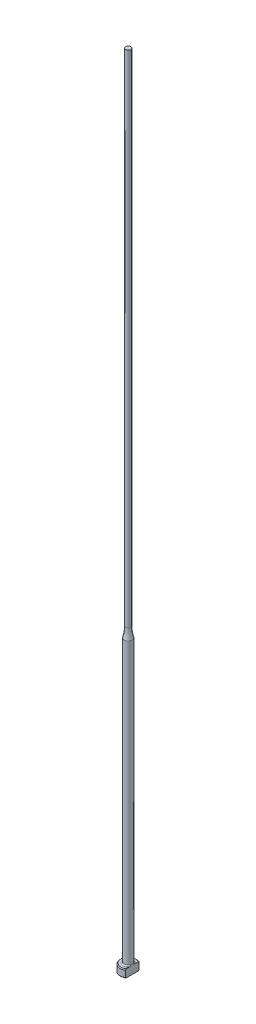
ISO-10303-21;
HEADER;
FILE_DESCRIPTION(('STEP AP214'),'2;1');
FILE_NAME('part.step','',(''),(''),'','','');
FILE_SCHEMA(('AUTOMOTIVE_DESIGN { 1 0 10303 214 1 1 1 1 }'));
ENDSEC;
DATA;
#1=APPLICATION_CONTEXT('core data for automotive mechanical design processes');
#2=APPLICATION_PROTOCOL_DEFINITION('international standard','automotive_design',2000,#1);
#3=PRODUCT_CONTEXT('',#1,'mechanical');
#4=PRODUCT('Part','Part','',(#3));
#5=PRODUCT_RELATED_PRODUCT_CATEGORY('part','',(#4));
#6=PRODUCT_DEFINITION_FORMATION('','',#4);
#7=PRODUCT_DEFINITION_CONTEXT('part definition',#1,'design');
#8=PRODUCT_DEFINITION('design','',#6,#7);
#9=PRODUCT_DEFINITION_SHAPE('','',#8);
#10=(LENGTH_UNIT() NAMED_UNIT(*) SI_UNIT(.MILLI.,.METRE.));
#11=(NAMED_UNIT(*) PLANE_ANGLE_UNIT() SI_UNIT($,.RADIAN.));
#12=(NAMED_UNIT(*) SI_UNIT($,.STERADIAN.) SOLID_ANGLE_UNIT());
#13=UNCERTAINTY_MEASURE_WITH_UNIT(LENGTH_MEASURE(1.E-05),#10,'distance_accuracy_value','');
#14=(GEOMETRIC_REPRESENTATION_CONTEXT(3) GLOBAL_UNCERTAINTY_ASSIGNED_CONTEXT((#13)) GLOBAL_UNIT_ASSIGNED_CONTEXT((#10,
#11,#12)) REPRESENTATION_CONTEXT('',''));
#15=CARTESIAN_POINT('',(0.,0.,0.));
#16=DIRECTION('',(0.,0.,1.));
#17=DIRECTION('',(1.,0.,0.));
#18=AXIS2_PLACEMENT_3D('',#15,#16,#17);
#19=CARTESIAN_POINT('',(-1.99999999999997,2.,0.));
#20=DIRECTION('',(0.,1.,0.));
#21=DIRECTION('',(0.,0.,1.));
#22=AXIS2_PLACEMENT_3D('',#19,#20,#21);
#23=PLANE('',#22);
#24=CARTESIAN_POINT('',(0.,2.,0.));
#25=DIRECTION('',(0.,1.,0.));
#26=DIRECTION('',(0.,0.,1.));
#27=AXIS2_PLACEMENT_3D('',#24,#25,#26);
#28=CIRCLE('',#27,1.8);
#29=CARTESIAN_POINT('',(0.999999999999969,2.,-1.4966629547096));
#30=VERTEX_POINT('',#29);
#31=CARTESIAN_POINT('',(0.999999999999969,2.,1.4966629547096));
#32=VERTEX_POINT('',#31);
#33=EDGE_CURVE('E187',#30,#32,#28,.T.);
#34=ORIENTED_EDGE('',*,*,#33,.T.);
#35=DIRECTION('',(0.,0.,-1.));
#36=VECTOR('',#35,1.);
#37=CARTESIAN_POINT('',(0.999999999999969,2.,0.));
#38=LINE('',#37,#36);
#39=CARTESIAN_POINT('',(0.999999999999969,2.00000000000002,0.830662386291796));
#40=VERTEX_POINT('',#39);
#41=EDGE_CURVE('E57',#32,#40,#38,.T.);
#42=ORIENTED_EDGE('',*,*,#41,.T.);
#43=CARTESIAN_POINT('',(0.,2.,0.));
#44=DIRECTION('',(0.,1.,0.));
#45=DIRECTION('',(0.,0.,1.));
#46=AXIS2_PLACEMENT_3D('',#43,#44,#45);
#47=CIRCLE('',#46,1.29999999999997);
#48=CARTESIAN_POINT('',(0.999999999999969,2.00000000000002,-0.830662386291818));
#49=VERTEX_POINT('',#48);
#50=EDGE_CURVE('E108',#40,#49,#47,.F.);
#51=ORIENTED_EDGE('',*,*,#50,.T.);
#52=EDGE_CURVE('E137',#49,#30,#38,.T.);
#53=ORIENTED_EDGE('',*,*,#52,.T.);
#54=EDGE_LOOP('',(#34,#42,#51,#53));
#55=FACE_BOUND('',#54,.T.);
#56=ADVANCED_FACE('F32',(#55),#23,.T.);
#57=CARTESIAN_POINT('',(0.,259.958771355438,0.));
#58=DIRECTION('',(0.,1.,0.));
#59=DIRECTION('',(0.,0.,1.));
#60=AXIS2_PLACEMENT_3D('',#57,#58,#59);
#61=CYLINDRICAL_SURFACE('',#60,1.99999999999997);
#62=CARTESIAN_POINT('',(0.,1.80000000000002,0.));
#63=DIRECTION('',(0.,1.,0.));
#64=DIRECTION('',(0.,0.,1.));
#65=AXIS2_PLACEMENT_3D('',#62,#63,#64);
#66=CIRCLE('',#65,1.99999999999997);
#67=CARTESIAN_POINT('',(0.999999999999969,1.80000000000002,1.73205080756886));
#68=VERTEX_POINT('',#67);
#69=CARTESIAN_POINT('',(0.999999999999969,1.80000000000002,-1.73205080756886));
#70=VERTEX_POINT('',#69);
#71=EDGE_CURVE('E105',#68,#70,#66,.F.);
#72=ORIENTED_EDGE('',*,*,#71,.T.);
#73=DIRECTION('',(0.,-1.,0.));
#74=VECTOR('',#73,1.);
#75=CARTESIAN_POINT('',(0.999999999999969,200.,-1.73205080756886));
#76=LINE('',#75,#74);
#77=CARTESIAN_POINT('',(0.999999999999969,0.199999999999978,-1.73205080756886));
#78=VERTEX_POINT('',#77);
#79=EDGE_CURVE('E193',#70,#78,#76,.T.);
#80=ORIENTED_EDGE('',*,*,#79,.T.);
#81=CARTESIAN_POINT('',(0.,0.199999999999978,0.));
#82=DIRECTION('',(0.,-1.,0.));
#83=DIRECTION('',(0.,0.,-1.));
#84=AXIS2_PLACEMENT_3D('',#81,#82,#83);
#85=CIRCLE('',#84,1.99999999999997);
#86=CARTESIAN_POINT('',(0.999999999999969,0.199999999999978,1.73205080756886));
#87=VERTEX_POINT('',#86);
#88=EDGE_CURVE('E100',#78,#87,#85,.F.);
#89=ORIENTED_EDGE('',*,*,#88,.T.);
#90=DIRECTION('',(0.,-1.,0.));
#91=VECTOR('',#90,1.);
#92=CARTESIAN_POINT('',(0.999999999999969,200.,1.73205080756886));
#93=LINE('',#92,#91);
#94=EDGE_CURVE('E93',#68,#87,#93,.T.);
#95=ORIENTED_EDGE('',*,*,#94,.F.);
#96=EDGE_LOOP('',(#72,#80,#89,#95));
#97=FACE_BOUND('',#96,.T.);
#98=ADVANCED_FACE('F158',(#97),#61,.T.);
#99=CARTESIAN_POINT('',(0.,0.,0.));
#100=DIRECTION('',(0.,-1.,0.));
#101=DIRECTION('',(0.,0.,-1.));
#102=AXIS2_PLACEMENT_3D('',#99,#100,#101);
#103=PLANE('',#102);
#104=CARTESIAN_POINT('',(0.,0.,0.));
#105=DIRECTION('',(0.,-1.,0.));
#106=DIRECTION('',(0.,0.,-1.));
#107=AXIS2_PLACEMENT_3D('',#104,#105,#106);
#108=CIRCLE('',#107,1.8);
#109=CARTESIAN_POINT('',(0.999999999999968,0.,1.49666295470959));
#110=VERTEX_POINT('',#109);
#111=CARTESIAN_POINT('',(0.999999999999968,0.,-1.49666295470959));
#112=VERTEX_POINT('',#111);
#113=EDGE_CURVE('E98',#110,#112,#108,.T.);
#114=ORIENTED_EDGE('',*,*,#113,.T.);
#115=DIRECTION('',(0.,0.,1.));
#116=VECTOR('',#115,1.);
#117=CARTESIAN_POINT('',(0.999999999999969,0.,-1.73205080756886));
#118=LINE('',#117,#116);
#119=EDGE_CURVE('E83',#112,#110,#118,.T.);
#120=ORIENTED_EDGE('',*,*,#119,.T.);
#121=EDGE_LOOP('',(#114,#120));
#122=FACE_BOUND('',#121,.T.);
#123=ADVANCED_FACE('F103',(#122),#103,.T.);
#124=CARTESIAN_POINT('',(0.,2.,0.));
#125=DIRECTION('',(0.,-1.,0.));
#126=DIRECTION('',(0.,0.,-1.));
#127=AXIS2_PLACEMENT_3D('',#124,#125,#126);
#128=CONICAL_SURFACE('',#127,1.8,0.785398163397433);
#129=ORIENTED_EDGE('',*,*,#71,.F.);
#130=CARTESIAN_POINT('',(0.999999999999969,-0.143084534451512,3.81417299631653));
#131=CARTESIAN_POINT('',(0.999999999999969,-0.0593997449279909,3.72765647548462));
#132=CARTESIAN_POINT('',(0.999999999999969,0.0241940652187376,3.64105173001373));
#133=CARTESIAN_POINT('',(0.999999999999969,0.191148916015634,3.46761616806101));
#134=CARTESIAN_POINT('',(0.999999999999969,0.274509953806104,3.38078534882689));
#135=CARTESIAN_POINT('',(0.999999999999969,0.524249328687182,3.11979400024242));
#136=CARTESIAN_POINT('',(0.999999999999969,0.690198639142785,2.94522254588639));
#137=CARTESIAN_POINT('',(0.999999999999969,1.016975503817,2.59782670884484));
#138=CARTESIAN_POINT('',(0.999999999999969,1.17783928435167,2.42503661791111));
#139=CARTESIAN_POINT('',(0.999999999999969,1.41669118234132,2.16364984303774));
#140=CARTESIAN_POINT('',(0.999999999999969,1.49589273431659,2.07616357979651));
#141=CARTESIAN_POINT('',(0.999999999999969,1.65313803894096,1.90015721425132));
#142=CARTESIAN_POINT('',(0.999999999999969,1.73118183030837,1.81163714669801));
#143=CARTESIAN_POINT('',(0.999999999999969,1.85567318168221,1.66767927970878));
#144=CARTESIAN_POINT('',(0.999999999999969,1.90265415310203,1.61270332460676));
#145=CARTESIAN_POINT('',(0.999999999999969,1.99577882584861,1.50203557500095));
#146=CARTESIAN_POINT('',(0.999999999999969,2.04192244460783,1.44634371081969));
#147=CARTESIAN_POINT('',(0.999999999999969,2.1335659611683,1.3334548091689));
#148=CARTESIAN_POINT('',(0.999999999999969,2.17905399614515,1.2762481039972));
#149=CARTESIAN_POINT('',(0.999999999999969,2.26844283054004,1.16060976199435));
#150=CARTESIAN_POINT('',(0.999999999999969,2.31234379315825,1.10217825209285));
#151=CARTESIAN_POINT('',(0.999999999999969,2.39853453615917,0.982773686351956));
#152=CARTESIAN_POINT('',(0.999999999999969,2.44078986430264,0.921775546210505));
#153=CARTESIAN_POINT('',(0.999999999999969,2.52187810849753,0.797387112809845));
#154=CARTESIAN_POINT('',(0.999999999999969,2.56070631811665,0.733993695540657));
#155=CARTESIAN_POINT('',(0.999999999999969,2.63248592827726,0.604932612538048));
#156=CARTESIAN_POINT('',(0.999999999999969,2.66550424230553,0.539302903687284));
#157=CARTESIAN_POINT('',(0.999999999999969,2.72301550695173,0.404437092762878));
#158=CARTESIAN_POINT('',(0.999999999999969,2.74753707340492,0.33521401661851));
#159=CARTESIAN_POINT('',(0.999999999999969,2.77407110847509,0.231400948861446));
#160=CARTESIAN_POINT('',(0.999999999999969,2.7811074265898,0.198093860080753));
#161=CARTESIAN_POINT('',(0.999999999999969,2.79200506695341,0.130954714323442));
#162=CARTESIAN_POINT('',(0.999999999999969,2.79586666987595,0.0971227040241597));
#163=CARTESIAN_POINT('',(0.999999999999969,2.8001390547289,0.0293410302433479));
#164=CARTESIAN_POINT('',(0.999999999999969,2.80056046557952,-0.00460794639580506));
#165=CARTESIAN_POINT('',(0.999999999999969,2.79795882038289,-0.0723663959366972));
#166=CARTESIAN_POINT('',(0.999999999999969,2.79493547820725,-0.106175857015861));
#167=CARTESIAN_POINT('',(0.999999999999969,2.78105481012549,-0.206326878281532));
#168=CARTESIAN_POINT('',(0.999999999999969,2.7654214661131,-0.272037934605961));
#169=CARTESIAN_POINT('',(0.999999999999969,2.73477554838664,-0.368312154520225));
#170=CARTESIAN_POINT('',(0.999999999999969,2.72331063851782,-0.40012349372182));
#171=CARTESIAN_POINT('',(0.999999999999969,2.69840546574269,-0.462964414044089));
#172=CARTESIAN_POINT('',(0.999999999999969,2.68496560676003,-0.493994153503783));
#173=CARTESIAN_POINT('',(0.999999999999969,2.64209309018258,-0.586298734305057));
#174=CARTESIAN_POINT('',(0.999999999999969,2.61022871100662,-0.64643570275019));
#175=CARTESIAN_POINT('',(0.999999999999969,2.54228534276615,-0.764304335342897));
#176=CARTESIAN_POINT('',(0.999999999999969,2.50620119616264,-0.822032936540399));
#177=CARTESIAN_POINT('',(0.999999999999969,2.43107084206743,-0.935840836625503));
#178=CARTESIAN_POINT('',(0.999999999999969,2.39201347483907,-0.991912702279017));
#179=CARTESIAN_POINT('',(0.999999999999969,2.31195870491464,-1.10259849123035));
#180=CARTESIAN_POINT('',(0.999999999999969,2.27096226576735,-1.15721311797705));
#181=CARTESIAN_POINT('',(0.999999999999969,2.18701695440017,-1.26606869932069));
#182=CARTESIAN_POINT('',(0.999999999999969,2.14404946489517,-1.32029522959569));
#183=CARTESIAN_POINT('',(0.999999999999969,2.05705050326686,-1.4278898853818));
#184=CARTESIAN_POINT('',(0.999999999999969,2.01301896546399,-1.48125795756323));
#185=CARTESIAN_POINT('',(0.999999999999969,1.87995068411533,-1.64010952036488));
#186=CARTESIAN_POINT('',(0.999999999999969,1.78973357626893,-1.74460261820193));
#187=CARTESIAN_POINT('',(0.999999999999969,1.62290341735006,-1.93426834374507));
#188=CARTESIAN_POINT('',(0.999999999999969,1.54658658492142,-2.01970404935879));
#189=CARTESIAN_POINT('',(0.999999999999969,1.39301250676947,-2.18973019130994));
#190=CARTESIAN_POINT('',(0.999999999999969,1.31575523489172,-2.27432060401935));
#191=CARTESIAN_POINT('',(0.999999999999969,1.08283440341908,-2.52732479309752));
#192=CARTESIAN_POINT('',(0.999999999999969,0.926165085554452,-2.69481086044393));
#193=CARTESIAN_POINT('',(0.999999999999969,0.617772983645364,-3.02147252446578));
#194=CARTESIAN_POINT('',(0.999999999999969,0.466111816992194,-3.18070657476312));
#195=CARTESIAN_POINT('',(0.999999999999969,0.238015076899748,-3.41880818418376));
#196=CARTESIAN_POINT('',(0.999999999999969,0.161924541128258,-3.49800657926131));
#197=CARTESIAN_POINT('',(0.999999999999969,0.009553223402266,-3.65621892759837));
#198=CARTESIAN_POINT('',(0.999999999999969,-0.0667275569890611,-3.73523288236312));
#199=CARTESIAN_POINT('',(0.999999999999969,-0.143084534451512,-3.81417299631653));
#200=B_SPLINE_CURVE_WITH_KNOTS('',3,(#130,#131,#132,#133,#134,#135,#136,#137,#138,#139,#140,
#141,#142,#143,#144,#145,#146,#147,#148,#149,#150,#151,#152,#153,#154,#155,#156,#157,#158,#159,
#160,#161,#162,#163,#164,#165,#166,#167,#168,#169,#170,#171,#172,#173,#174,#175,#176,#177,#178,
#179,#180,#181,#182,#183,#184,#185,#186,#187,#188,#189,#190,#191,#192,#193,#194,#195,#196,#197,
#198,#199),.UNSPECIFIED.,.F.,.F.,(4,2,2,2,2,2,2,2,2,2,2,2,2,2,2,2,2,2,2,2,2,2,2,2,2,2,2,2,2,2,2,
2,2,2,4),(0.,0.36110162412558,0.722207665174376,1.44478731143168,2.15299784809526,
2.5070263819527,2.8610430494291,3.07798416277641,3.29494655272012,3.51418925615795,
3.73340935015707,3.95594813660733,4.17878792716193,4.39886399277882,4.61819150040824,
4.72018864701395,4.82217677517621,4.92384967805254,5.02553102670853,5.22698459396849,
5.32838854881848,5.42977179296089,5.63365200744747,5.83778406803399,6.04272417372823,
6.24756349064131,6.45510395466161,6.66265726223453,7.07676259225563,7.42043039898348,
7.7641077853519,8.45210822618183,9.1118082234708,9.44129145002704,9.77077197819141),.UNSPECIFIED.);
#201=EDGE_CURVE('E136',#68,#32,#200,.T.);
#202=ORIENTED_EDGE('',*,*,#201,.T.);
#203=ORIENTED_EDGE('',*,*,#33,.F.);
#204=EDGE_CURVE('E128',#30,#70,#200,.T.);
#205=ORIENTED_EDGE('',*,*,#204,.T.);
#206=EDGE_LOOP('',(#129,#202,#203,#205));
#207=FACE_BOUND('',#206,.T.);
#208=ADVANCED_FACE('F144',(#207),#128,.T.);
#209=CARTESIAN_POINT('',(0.,0.199999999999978,0.));
#210=DIRECTION('',(0.,1.,0.));
#211=DIRECTION('',(0.,0.,1.));
#212=AXIS2_PLACEMENT_3D('',#209,#210,#211);
#213=CONICAL_SURFACE('',#212,1.99999999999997,0.785398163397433);
#214=ORIENTED_EDGE('',*,*,#88,.F.);
#215=CARTESIAN_POINT('',(0.999999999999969,2.14308453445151,-3.81417299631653));
#216=CARTESIAN_POINT('',(0.999999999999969,2.05939974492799,-3.72765647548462));
#217=CARTESIAN_POINT('',(0.999999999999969,1.97580593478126,-3.64105173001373));
#218=CARTESIAN_POINT('',(0.999999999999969,1.80885108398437,-3.46761616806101));
#219=CARTESIAN_POINT('',(0.999999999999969,1.7254900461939,-3.38078534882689));
#220=CARTESIAN_POINT('',(0.999999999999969,1.47575067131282,-3.11979400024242));
#221=CARTESIAN_POINT('',(0.999999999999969,1.30980136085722,-2.94522254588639));
#222=CARTESIAN_POINT('',(0.999999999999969,0.983024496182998,-2.59782670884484));
#223=CARTESIAN_POINT('',(0.999999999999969,0.822160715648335,-2.42503661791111));
#224=CARTESIAN_POINT('',(0.999999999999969,0.583308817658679,-2.16364984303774));
#225=CARTESIAN_POINT('',(0.999999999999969,0.504107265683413,-2.07616357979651));
#226=CARTESIAN_POINT('',(0.999999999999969,0.346861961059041,-1.90015721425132));
#227=CARTESIAN_POINT('',(0.999999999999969,0.268818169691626,-1.81163714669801));
#228=CARTESIAN_POINT('',(0.999999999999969,0.144326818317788,-1.66767927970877));
#229=CARTESIAN_POINT('',(0.999999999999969,0.0973458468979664,-1.61270332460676));
#230=CARTESIAN_POINT('',(0.999999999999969,0.00422117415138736,-1.50203557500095));
#231=CARTESIAN_POINT('',(0.999999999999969,-0.0419224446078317,-1.44634371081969));
#232=CARTESIAN_POINT('',(0.999999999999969,-0.133565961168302,-1.3334548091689));
#233=CARTESIAN_POINT('',(0.999999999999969,-0.179053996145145,-1.2762481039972));
#234=CARTESIAN_POINT('',(0.999999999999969,-0.268442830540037,-1.16060976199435));
#235=CARTESIAN_POINT('',(0.999999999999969,-0.31234379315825,-1.10217825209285));
#236=CARTESIAN_POINT('',(0.999999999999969,-0.398534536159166,-0.982773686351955));
#237=CARTESIAN_POINT('',(0.999999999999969,-0.440789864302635,-0.921775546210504));
#238=CARTESIAN_POINT('',(0.999999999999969,-0.521878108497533,-0.797387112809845));
#239=CARTESIAN_POINT('',(0.999999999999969,-0.560706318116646,-0.733993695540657));
#240=CARTESIAN_POINT('',(0.999999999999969,-0.632485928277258,-0.604932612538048));
#241=CARTESIAN_POINT('',(0.999999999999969,-0.665504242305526,-0.539302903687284));
#242=CARTESIAN_POINT('',(0.999999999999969,-0.723015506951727,-0.404437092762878));
#243=CARTESIAN_POINT('',(0.999999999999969,-0.747537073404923,-0.33521401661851));
#244=CARTESIAN_POINT('',(0.999999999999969,-0.774071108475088,-0.231400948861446));
#245=CARTESIAN_POINT('',(0.999999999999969,-0.781107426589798,-0.198093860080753));
#246=CARTESIAN_POINT('',(0.999999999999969,-0.792005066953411,-0.130954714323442));
#247=CARTESIAN_POINT('',(0.999999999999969,-0.795866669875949,-0.0971227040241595));
#248=CARTESIAN_POINT('',(0.999999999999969,-0.800139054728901,-0.0293410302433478));
#249=CARTESIAN_POINT('',(0.999999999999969,-0.80056046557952,0.00460794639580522));
#250=CARTESIAN_POINT('',(0.999999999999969,-0.797958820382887,0.0723663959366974));
#251=CARTESIAN_POINT('',(0.999999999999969,-0.794935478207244,0.106175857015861));
#252=CARTESIAN_POINT('',(0.999999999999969,-0.78105481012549,0.206326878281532));
#253=CARTESIAN_POINT('',(0.999999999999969,-0.765421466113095,0.272037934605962));
#254=CARTESIAN_POINT('',(0.999999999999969,-0.734775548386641,0.368312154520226));
#255=CARTESIAN_POINT('',(0.999999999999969,-0.723310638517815,0.40012349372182));
#256=CARTESIAN_POINT('',(0.999999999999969,-0.698405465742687,0.46296441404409));
#257=CARTESIAN_POINT('',(0.999999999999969,-0.684965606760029,0.493994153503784));
#258=CARTESIAN_POINT('',(0.999999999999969,-0.642093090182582,0.586298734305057));
#259=CARTESIAN_POINT('',(0.999999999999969,-0.610228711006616,0.64643570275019));
#260=CARTESIAN_POINT('',(0.999999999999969,-0.542285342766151,0.764304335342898));
#261=CARTESIAN_POINT('',(0.999999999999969,-0.506201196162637,0.822032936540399));
#262=CARTESIAN_POINT('',(0.999999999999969,-0.431070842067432,0.935840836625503));
#263=CARTESIAN_POINT('',(0.999999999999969,-0.392013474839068,0.991912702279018));
#264=CARTESIAN_POINT('',(0.999999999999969,-0.311958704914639,1.10259849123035));
#265=CARTESIAN_POINT('',(0.999999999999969,-0.27096226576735,1.15721311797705));
#266=CARTESIAN_POINT('',(0.999999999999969,-0.187016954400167,1.26606869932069));
#267=CARTESIAN_POINT('',(0.999999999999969,-0.144049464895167,1.32029522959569));
#268=CARTESIAN_POINT('',(0.999999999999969,-0.0570505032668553,1.4278898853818));
#269=CARTESIAN_POINT('',(0.999999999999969,-0.0130189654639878,1.48125795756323));
#270=CARTESIAN_POINT('',(0.999999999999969,0.120049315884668,1.64010952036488));
#271=CARTESIAN_POINT('',(0.999999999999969,0.210266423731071,1.74460261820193));
#272=CARTESIAN_POINT('',(0.999999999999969,0.377096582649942,1.93426834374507));
#273=CARTESIAN_POINT('',(0.999999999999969,0.453413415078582,2.01970404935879));
#274=CARTESIAN_POINT('',(0.999999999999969,0.606987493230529,2.18973019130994));
#275=CARTESIAN_POINT('',(0.999999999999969,0.684244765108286,2.27432060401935));
#276=CARTESIAN_POINT('',(0.999999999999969,0.917165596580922,2.52732479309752));
#277=CARTESIAN_POINT('',(0.999999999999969,1.07383491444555,2.69481086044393));
#278=CARTESIAN_POINT('',(0.999999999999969,1.38222701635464,3.02147252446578));
#279=CARTESIAN_POINT('',(0.999999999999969,1.53388818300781,3.18070657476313));
#280=CARTESIAN_POINT('',(0.999999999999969,1.76198492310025,3.41880818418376));
#281=CARTESIAN_POINT('',(0.999999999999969,1.83807545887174,3.49800657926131));
#282=CARTESIAN_POINT('',(0.999999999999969,1.99044677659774,3.65621892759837));
#283=CARTESIAN_POINT('',(0.999999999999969,2.06672755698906,3.73523288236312));
#284=CARTESIAN_POINT('',(0.999999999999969,2.14308453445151,3.81417299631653));
#285=B_SPLINE_CURVE_WITH_KNOTS('',3,(#215,#216,#217,#218,#219,#220,#221,#222,#223,#224,#225,
#226,#227,#228,#229,#230,#231,#232,#233,#234,#235,#236,#237,#238,#239,#240,#241,#242,#243,#244,
#245,#246,#247,#248,#249,#250,#251,#252,#253,#254,#255,#256,#257,#258,#259,#260,#261,#262,#263,
#264,#265,#266,#267,#268,#269,#270,#271,#272,#273,#274,#275,#276,#277,#278,#279,#280,#281,#282,
#283,#284),.UNSPECIFIED.,.F.,.F.,(4,2,2,2,2,2,2,2,2,2,2,2,2,2,2,2,2,2,2,2,2,2,2,2,2,2,2,2,2,2,2,
2,2,2,4),(0.,0.36110162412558,0.722207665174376,1.44478731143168,2.15299784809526,
2.5070263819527,2.8610430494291,3.07798416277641,3.29494655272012,3.51418925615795,
3.73340935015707,3.95594813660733,4.17878792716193,4.39886399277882,4.61819150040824,
4.72018864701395,4.82217677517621,4.92384967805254,5.02553102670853,5.22698459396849,
5.32838854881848,5.42977179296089,5.63365200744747,5.83778406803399,6.04272417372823,
6.24756349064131,6.45510395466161,6.66265726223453,7.07676259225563,7.42043039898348,
7.7641077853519,8.45210822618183,9.1118082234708,9.44129145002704,9.77077197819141),.UNSPECIFIED.);
#286=EDGE_CURVE('E86',#78,#112,#285,.T.);
#287=ORIENTED_EDGE('',*,*,#286,.T.);
#288=ORIENTED_EDGE('',*,*,#113,.F.);
#289=EDGE_CURVE('E89',#110,#87,#285,.T.);
#290=ORIENTED_EDGE('',*,*,#289,.T.);
#291=EDGE_LOOP('',(#214,#287,#288,#290));
#292=FACE_BOUND('',#291,.T.);
#293=ADVANCED_FACE('F97',(#292),#213,.T.);
#294=CARTESIAN_POINT('',(0.,2.30000000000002,0.));
#295=DIRECTION('',(0.,1.,0.));
#296=DIRECTION('',(0.,0.,1.));
#297=AXIS2_PLACEMENT_3D('',#294,#295,#296);
#298=TOROIDAL_SURFACE('',#297,1.29999999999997,0.3);
#299=CARTESIAN_POINT('',(0.999999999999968,2.30000000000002,0.));
#300=CARTESIAN_POINT('',(0.999999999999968,2.30000064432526,8.65739792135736E-12));
#301=CARTESIAN_POINT('',(0.999999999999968,2.30000128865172,-9.05742230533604E-08));
#302=CARTESIAN_POINT('',(0.999999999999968,2.30000254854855,-3.98319619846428E-07));
#303=CARTESIAN_POINT('',(0.999999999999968,2.30000316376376,-6.16748312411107E-07));
#304=CARTESIAN_POINT('',(0.999999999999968,2.30000438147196,-1.15047367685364E-06));
#305=CARTESIAN_POINT('',(0.999999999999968,2.30000498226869,-1.46954564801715E-06));
#306=CARTESIAN_POINT('',(0.999999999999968,2.30000613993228,-2.17388585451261E-06));
#307=CARTESIAN_POINT('',(0.999999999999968,2.30000669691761,-2.55896592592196E-06));
#308=CARTESIAN_POINT('',(0.999999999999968,2.30000847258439,-3.89137454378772E-06));
#309=CARTESIAN_POINT('',(0.999999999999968,2.30000962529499,-4.92725692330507E-06));
#310=CARTESIAN_POINT('',(0.999999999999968,2.30001175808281,-7.12255375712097E-06));
#311=CARTESIAN_POINT('',(0.999999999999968,2.30001274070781,-8.27963245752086E-06));
#312=CARTESIAN_POINT('',(0.999999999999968,2.30001619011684,-1.25710395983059E-05));
#313=CARTESIAN_POINT('',(0.999999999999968,2.30001847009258,-1.58589994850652E-05));
#314=CARTESIAN_POINT('',(0.999999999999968,2.30002241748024,-2.25210462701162E-05));
#315=CARTESIAN_POINT('',(0.999999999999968,2.30002411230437,-2.58796667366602E-05));
#316=CARTESIAN_POINT('',(0.999999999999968,2.30003085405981,-3.9494195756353E-05));
#317=CARTESIAN_POINT('',(0.999999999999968,2.30003568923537,-4.98493079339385E-05));
#318=CARTESIAN_POINT('',(0.999999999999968,2.30004388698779,-6.96407730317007E-05));
#319=CARTESIAN_POINT('',(0.999999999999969,2.30004735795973,-7.90309862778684E-05));
#320=CARTESIAN_POINT('',(0.999999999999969,2.30007348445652,-0.00014405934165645));
#321=CARTESIAN_POINT('',(0.999999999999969,2.30010510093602,-0.000195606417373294));
#322=CARTESIAN_POINT('',(0.999999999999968,2.30022061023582,-0.000391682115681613));
#323=CARTESIAN_POINT('',(0.999999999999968,2.30029784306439,-0.000539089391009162));
#324=CARTESIAN_POINT('',(0.999999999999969,2.30059433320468,-0.00109591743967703));
#325=CARTESIAN_POINT('',(0.999999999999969,2.30082052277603,-0.00150237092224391));
#326=CARTESIAN_POINT('',(0.999999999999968,2.30171558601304,-0.00311941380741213));
#327=CARTESIAN_POINT('',(0.999999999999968,2.30237677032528,-0.00433326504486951));
#328=CARTESIAN_POINT('',(0.999999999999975,2.31602135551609,-0.0293725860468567));
#329=CARTESIAN_POINT('',(0.99999999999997,2.32909104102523,-0.0531623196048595));
#330=CARTESIAN_POINT('',(0.999999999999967,2.35458080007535,-0.100088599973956));
#331=CARTESIAN_POINT('',(0.999999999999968,2.36700820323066,-0.123221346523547));
#332=CARTESIAN_POINT('',(0.999999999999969,2.39281545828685,-0.172044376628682));
#333=CARTESIAN_POINT('',(0.999999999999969,2.40616161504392,-0.197752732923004));
#334=CARTESIAN_POINT('',(0.999999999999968,2.43235418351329,-0.249714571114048));
#335=CARTESIAN_POINT('',(0.999999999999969,2.44519503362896,-0.275970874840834));
#336=CARTESIAN_POINT('',(0.999999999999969,2.46718175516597,-0.322864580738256));
#337=CARTESIAN_POINT('',(0.999999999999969,2.47650292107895,-0.34341923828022));
#338=CARTESIAN_POINT('',(0.999999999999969,2.49448113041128,-0.384761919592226));
#339=CARTESIAN_POINT('',(0.999999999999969,2.50313958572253,-0.405549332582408));
#340=CARTESIAN_POINT('',(0.999999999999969,2.52764343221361,-0.467585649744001));
#341=CARTESIAN_POINT('',(0.999999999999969,2.54239224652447,-0.509286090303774));
#342=CARTESIAN_POINT('',(0.999999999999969,2.56458900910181,-0.58349816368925));
#343=CARTESIAN_POINT('',(0.999999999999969,2.57294045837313,-0.61573699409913));
#344=CARTESIAN_POINT('',(0.999999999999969,2.58691787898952,-0.682155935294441));
#345=CARTESIAN_POINT('',(0.999999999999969,2.5924232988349,-0.716362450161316));
#346=CARTESIAN_POINT('',(0.999999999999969,2.59932200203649,-0.784996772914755));
#347=CARTESIAN_POINT('',(0.999999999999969,2.60074119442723,-0.819421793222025));
#348=CARTESIAN_POINT('',(0.999999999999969,2.59853032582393,-0.88779225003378));
#349=CARTESIAN_POINT('',(0.999999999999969,2.59495737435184,-0.921738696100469));
#350=CARTESIAN_POINT('',(0.999999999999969,2.58381038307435,-0.977927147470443));
#351=CARTESIAN_POINT('',(0.999999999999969,2.57785171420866,-1.00048693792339));
#352=CARTESIAN_POINT('',(0.999999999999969,2.56267132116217,-1.0445512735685));
#353=CARTESIAN_POINT('',(0.999999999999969,2.55344592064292,-1.06605459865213));
#354=CARTESIAN_POINT('',(0.999999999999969,2.53348156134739,-1.10327564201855));
#355=CARTESIAN_POINT('',(0.999999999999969,2.52335553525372,-1.11931996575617));
#356=CARTESIAN_POINT('',(0.999999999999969,2.50063930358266,-1.1495565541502));
#357=CARTESIAN_POINT('',(0.999999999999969,2.48805327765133,-1.16375189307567));
#358=CARTESIAN_POINT('',(0.999999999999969,2.46313284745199,-1.18709127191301));
#359=CARTESIAN_POINT('',(0.999999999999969,2.45121755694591,-1.19668155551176));
#360=CARTESIAN_POINT('',(0.999999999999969,2.4259612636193,-1.21377371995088));
#361=CARTESIAN_POINT('',(0.999999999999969,2.41262072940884,-1.2212762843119));
#362=CARTESIAN_POINT('',(0.999999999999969,2.38471163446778,-1.23381879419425));
#363=CARTESIAN_POINT('',(0.999999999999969,2.37013565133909,-1.23884240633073));
#364=CARTESIAN_POINT('',(0.999999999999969,2.34029120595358,-1.2460136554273));
#365=CARTESIAN_POINT('',(0.999999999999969,2.32502317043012,-1.24816304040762));
#366=CARTESIAN_POINT('',(0.999999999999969,2.29609418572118,-1.24936303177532));
#367=CARTESIAN_POINT('',(0.999999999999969,2.28244572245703,-1.24873511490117));
#368=CARTESIAN_POINT('',(0.999999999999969,2.25546467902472,-1.24513625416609));
#369=CARTESIAN_POINT('',(0.999999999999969,2.2421320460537,-1.24216570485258));
#370=CARTESIAN_POINT('',(0.999999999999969,2.21644742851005,-1.23414136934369));
#371=CARTESIAN_POINT('',(0.999999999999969,2.20408009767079,-1.22913614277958));
#372=CARTESIAN_POINT('',(0.999999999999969,2.18026539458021,-1.2172891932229));
#373=CARTESIAN_POINT('',(0.999999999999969,2.16881815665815,-1.21044720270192));
#374=CARTESIAN_POINT('',(0.999999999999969,2.14602713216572,-1.19450929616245));
#375=CARTESIAN_POINT('',(0.999999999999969,2.1347876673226,-1.18526487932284));
#376=CARTESIAN_POINT('',(0.999999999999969,2.11372805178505,-1.16528066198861));
#377=CARTESIAN_POINT('',(0.999999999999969,2.1039092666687,-1.15453944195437));
#378=CARTESIAN_POINT('',(0.999999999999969,2.08131380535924,-1.12639326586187));
#379=CARTESIAN_POINT('',(0.999999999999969,2.06941227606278,-1.10828305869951));
#380=CARTESIAN_POINT('',(0.999999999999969,2.04871157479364,-1.07041295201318));
#381=CARTESIAN_POINT('',(0.999999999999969,2.03991325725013,-1.05065259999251));
#382=CARTESIAN_POINT('',(0.999999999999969,2.02219264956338,-1.00203188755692));
#383=CARTESIAN_POINT('',(0.999999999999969,2.01461756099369,-0.97268259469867));
#384=CARTESIAN_POINT('',(0.999999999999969,2.00410660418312,-0.912914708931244));
#385=CARTESIAN_POINT('',(0.999999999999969,2.00122174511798,-0.882487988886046));
#386=CARTESIAN_POINT('',(0.999999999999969,1.99886242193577,-0.803189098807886));
#387=CARTESIAN_POINT('',(0.999999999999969,2.0024814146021,-0.754226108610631));
#388=CARTESIAN_POINT('',(0.999999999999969,2.01327071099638,-0.68272407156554));
#389=CARTESIAN_POINT('',(0.999999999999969,2.01762186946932,-0.659663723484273));
#390=CARTESIAN_POINT('',(0.999999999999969,2.02775671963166,-0.613959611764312));
#391=CARTESIAN_POINT('',(0.999999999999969,2.03353398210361,-0.591314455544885));
#392=CARTESIAN_POINT('',(0.999999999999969,2.05232003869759,-0.525222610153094));
#393=CARTESIAN_POINT('',(0.999999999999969,2.0670175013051,-0.482256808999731));
#394=CARTESIAN_POINT('',(0.999999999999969,2.09166172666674,-0.418361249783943));
#395=CARTESIAN_POINT('',(0.999999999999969,2.10040936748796,-0.396945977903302));
#396=CARTESIAN_POINT('',(0.999999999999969,2.11862724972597,-0.354367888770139));
#397=CARTESIAN_POINT('',(0.999999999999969,2.12809902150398,-0.333205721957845));
#398=CARTESIAN_POINT('',(0.999999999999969,2.1505479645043,-0.284809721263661));
#399=CARTESIAN_POINT('',(0.999999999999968,2.16372144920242,-0.257667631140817));
#400=CARTESIAN_POINT('',(0.999999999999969,2.19063957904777,-0.203972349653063));
#401=CARTESIAN_POINT('',(0.999999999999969,2.20437810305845,-0.177416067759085));
#402=CARTESIAN_POINT('',(0.999999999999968,2.23096755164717,-0.127000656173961));
#403=CARTESIAN_POINT('',(0.999999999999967,2.24378127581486,-0.103121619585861));
#404=CARTESIAN_POINT('',(0.99999999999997,2.2700750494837,-0.0546869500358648));
#405=CARTESIAN_POINT('',(0.999999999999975,2.28356304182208,-0.0301354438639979));
#406=CARTESIAN_POINT('',(0.999999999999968,2.29762327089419,-0.00433318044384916));
#407=CARTESIAN_POINT('',(0.999999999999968,2.29828450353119,-0.00311924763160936));
#408=CARTESIAN_POINT('',(0.999999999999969,2.29917957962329,-0.0015021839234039));
#409=CARTESIAN_POINT('',(0.999999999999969,2.29940573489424,-0.00109579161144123));
#410=CARTESIAN_POINT('',(0.999999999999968,2.29970218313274,-0.000539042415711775));
#411=CARTESIAN_POINT('',(0.999999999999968,2.29977940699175,-0.00039165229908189));
#412=CARTESIAN_POINT('',(0.999999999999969,2.299894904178,-0.000195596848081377));
#413=CARTESIAN_POINT('',(0.999999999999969,2.29992651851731,-0.000144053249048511));
#414=CARTESIAN_POINT('',(0.999999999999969,2.29995264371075,-7.90290824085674E-05));
#415=CARTESIAN_POINT('',(0.999999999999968,2.29995611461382,-6.96391975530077E-05));
#416=CARTESIAN_POINT('',(0.999999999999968,2.29996431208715,-4.98484228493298E-05));
#417=CARTESIAN_POINT('',(0.999999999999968,2.29996914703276,-3.94936645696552E-05));
#418=CARTESIAN_POINT('',(0.999999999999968,2.2999758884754,-2.58795342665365E-05));
#419=CARTESIAN_POINT('',(0.999999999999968,2.29997758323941,-2.25209724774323E-05));
#420=CARTESIAN_POINT('',(0.999999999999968,2.29998153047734,-1.58590310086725E-05));
#421=CARTESIAN_POINT('',(0.999999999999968,2.29998381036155,-1.25711163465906E-05));
#422=CARTESIAN_POINT('',(0.999999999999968,2.29998725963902,-8.2797491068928E-06));
#423=CARTESIAN_POINT('',(0.999999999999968,2.29998824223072,-7.12267538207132E-06));
#424=CARTESIAN_POINT('',(0.999999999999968,2.29999037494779,-4.92738159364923E-06));
#425=CARTESIAN_POINT('',(0.999999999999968,2.29999152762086,-3.89149712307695E-06));
#426=CARTESIAN_POINT('',(0.999999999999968,2.29999330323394,-2.55907740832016E-06));
#427=CARTESIAN_POINT('',(0.999999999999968,2.29999386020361,-2.17399249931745E-06));
#428=CARTESIAN_POINT('',(0.999999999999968,2.2999950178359,-1.46963989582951E-06));
#429=CARTESIAN_POINT('',(0.999999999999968,2.299995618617,-1.15056035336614E-06));
#430=CARTESIAN_POINT('',(0.999999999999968,2.29999683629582,-6.16816558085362E-07));
#431=CARTESIAN_POINT('',(0.999999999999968,2.29999745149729,-3.98377207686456E-07));
#432=CARTESIAN_POINT('',(0.999999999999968,2.29999871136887,-9.06063086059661E-08));
#433=CARTESIAN_POINT('',(0.999999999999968,2.29999935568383,-8.65727637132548E-12));
#434=CARTESIAN_POINT('',(0.999999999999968,2.30000000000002,0.));
#435=B_SPLINE_CURVE_WITH_KNOTS('',3,(#299,#300,#301,#302,#303,#304,#305,#306,#307,#308,#309,
#310,#311,#312,#313,#314,#315,#316,#317,#318,#319,#320,#321,#322,#323,#324,#325,#326,#327,#328,
#329,#330,#331,#332,#333,#334,#335,#336,#337,#338,#339,#340,#341,#342,#343,#344,#345,#346,#347,
#348,#349,#350,#351,#352,#353,#354,#355,#356,#357,#358,#359,#360,#361,#362,#363,#364,#365,#366,
#367,#368,#369,#370,#371,#372,#373,#374,#375,#376,#377,#378,#379,#380,#381,#382,#383,#384,#385,
#386,#387,#388,#389,#390,#391,#392,#393,#394,#395,#396,#397,#398,#399,#400,#401,#402,#403,#404,
#405,#406,#407,#408,#409,#410,#411,#412,#413,#414,#415,#416,#417,#418,#419,#420,#421,#422,#423,
#424,#425,#426,#427,#428,#429,#430,#431,#432,#433,#434),.UNSPECIFIED.,.T.,.F.,(4,2,2,2,2,2,2,2,
2,2,2,2,2,2,2,2,2,2,2,2,2,2,2,2,2,2,2,2,2,2,2,2,2,2,2,2,2,2,2,2,2,2,2,2,2,2,2,2,2,2,2,2,2,2,2,2,
2,2,2,2,2,2,2,2,2,2,2,4),(0.,1.93088000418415E-06,3.88121487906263E-06,5.91576028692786E-06,
7.94459960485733E-06,1.25713540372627E-05,1.71213139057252E-05,2.90751202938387E-05,
4.03508177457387E-05,7.46190414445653E-05,0.000104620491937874,0.000284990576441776,
0.000785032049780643,0.00217951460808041,0.00632720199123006,0.0877445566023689,
0.166524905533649,0.25341742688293,0.341089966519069,0.408787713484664,0.476336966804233,
0.608850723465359,0.708652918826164,0.812393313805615,0.915474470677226,1.01738599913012,
1.08718721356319,1.15706723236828,1.21377727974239,1.27039179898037,1.31609373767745,
1.36178069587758,1.40776478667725,1.45372089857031,1.49450576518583,1.53528376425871,
1.57514089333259,1.61500383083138,1.65849635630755,1.70203041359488,1.76667915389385,
1.83134568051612,1.92177629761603,2.01318398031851,2.15955153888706,2.22993031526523,
2.29999742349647,2.4360081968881,2.50540041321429,2.57494356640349,2.66544006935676,
2.75513178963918,2.83643278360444,2.9204568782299,2.92460484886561,2.92599912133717,
2.92649910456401,2.92667946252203,2.92670946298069,2.92674372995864,2.92675500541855,
2.92676695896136,2.92677150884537,2.92677613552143,2.92677816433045,2.92678019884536,
2.92678214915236,2.92678408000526),.UNSPECIFIED.);
#436=CARTESIAN_POINT('',(0.999999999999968,2.30000000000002,0.));
#437=VERTEX_POINT('',#436);
#438=EDGE_CURVE('E11',#49,#437,#435,.T.);
#439=ORIENTED_EDGE('',*,*,#438,.F.);
#440=ORIENTED_EDGE('',*,*,#50,.F.);
#441=CARTESIAN_POINT('',(0.999999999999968,2.30000000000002,0.));
#442=CARTESIAN_POINT('',(0.999999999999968,2.29999935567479,-8.65738879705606E-12));
#443=CARTESIAN_POINT('',(0.999999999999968,2.29999871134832,9.05742230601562E-08));
#444=CARTESIAN_POINT('',(0.999999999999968,2.2999974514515,3.9831961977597E-07));
#445=CARTESIAN_POINT('',(0.999999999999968,2.29999683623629,6.16748312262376E-07));
#446=CARTESIAN_POINT('',(0.999999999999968,2.29999561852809,1.15047367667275E-06));
#447=CARTESIAN_POINT('',(0.999999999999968,2.29999501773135,1.46954564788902E-06));
#448=CARTESIAN_POINT('',(0.999999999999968,2.29999386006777,2.17388585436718E-06));
#449=CARTESIAN_POINT('',(0.999999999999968,2.29999330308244,2.55896592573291E-06));
#450=CARTESIAN_POINT('',(0.999999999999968,2.29999152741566,3.89137454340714E-06));
#451=CARTESIAN_POINT('',(0.999999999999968,2.29999037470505,4.92725692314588E-06));
#452=CARTESIAN_POINT('',(0.999999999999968,2.29998824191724,7.12255375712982E-06));
#453=CARTESIAN_POINT('',(0.999999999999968,2.29998725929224,8.2796324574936E-06));
#454=CARTESIAN_POINT('',(0.999999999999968,2.29998380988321,1.25710395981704E-05));
#455=CARTESIAN_POINT('',(0.999999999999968,2.29998152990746,1.58589994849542E-05));
#456=CARTESIAN_POINT('',(0.999999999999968,2.2999775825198,2.25210462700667E-05));
#457=CARTESIAN_POINT('',(0.999999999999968,2.29997588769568,2.58796667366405E-05));
#458=CARTESIAN_POINT('',(0.999999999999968,2.29996914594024,3.94941957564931E-05));
#459=CARTESIAN_POINT('',(0.999999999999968,2.29996431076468,4.98493079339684E-05));
#460=CARTESIAN_POINT('',(0.999999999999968,2.29995611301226,6.96407730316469E-05));
#461=CARTESIAN_POINT('',(0.999999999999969,2.29995264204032,7.90309862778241E-05));
#462=CARTESIAN_POINT('',(0.999999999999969,2.29992651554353,0.000144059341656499));
#463=CARTESIAN_POINT('',(0.999999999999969,2.29989489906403,0.00019560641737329));
#464=CARTESIAN_POINT('',(0.999999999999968,2.29977938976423,0.000391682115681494));
#465=CARTESIAN_POINT('',(0.999999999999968,2.29970215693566,0.000539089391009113));
#466=CARTESIAN_POINT('',(0.999999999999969,2.29940566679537,0.00109591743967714));
#467=CARTESIAN_POINT('',(0.999999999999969,2.29917947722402,0.00150237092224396));
#468=CARTESIAN_POINT('',(0.999999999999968,2.29828441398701,0.003119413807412));
#469=CARTESIAN_POINT('',(0.999999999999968,2.29762322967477,0.00433326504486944));
#470=CARTESIAN_POINT('',(0.999999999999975,2.28397864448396,0.0293725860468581));
#471=CARTESIAN_POINT('',(0.99999999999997,2.27090895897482,0.0531623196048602));
#472=CARTESIAN_POINT('',(0.999999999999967,2.2454191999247,0.100088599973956));
#473=CARTESIAN_POINT('',(0.999999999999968,2.23299179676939,0.123221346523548));
#474=CARTESIAN_POINT('',(0.999999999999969,2.2071845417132,0.172044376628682));
#475=CARTESIAN_POINT('',(0.999999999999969,2.19383838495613,0.197752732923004));
#476=CARTESIAN_POINT('',(0.999999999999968,2.16764581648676,0.249714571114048));
#477=CARTESIAN_POINT('',(0.999999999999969,2.15480496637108,0.275970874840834));
#478=CARTESIAN_POINT('',(0.999999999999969,2.13281824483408,0.322864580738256));
#479=CARTESIAN_POINT('',(0.999999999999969,2.12349707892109,0.34341923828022));
#480=CARTESIAN_POINT('',(0.999999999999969,2.10551886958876,0.384761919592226));
#481=CARTESIAN_POINT('',(0.999999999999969,2.09686041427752,0.405549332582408));
#482=CARTESIAN_POINT('',(0.999999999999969,2.07235656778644,0.467585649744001));
#483=CARTESIAN_POINT('',(0.999999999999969,2.05760775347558,0.509286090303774));
#484=CARTESIAN_POINT('',(0.999999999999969,2.03541099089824,0.58349816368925));
#485=CARTESIAN_POINT('',(0.999999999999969,2.02705954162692,0.61573699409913));
#486=CARTESIAN_POINT('',(0.999999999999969,2.01308212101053,0.682155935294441));
#487=CARTESIAN_POINT('',(0.999999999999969,2.00757670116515,0.716362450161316));
#488=CARTESIAN_POINT('',(0.999999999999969,2.00067799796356,0.784996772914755));
#489=CARTESIAN_POINT('',(0.999999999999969,1.99925880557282,0.819421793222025));
#490=CARTESIAN_POINT('',(0.999999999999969,2.00146967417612,0.88779225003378));
#491=CARTESIAN_POINT('',(0.999999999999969,2.00504262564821,0.921738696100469));
#492=CARTESIAN_POINT('',(0.999999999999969,2.0161896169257,0.977927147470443));
#493=CARTESIAN_POINT('',(0.999999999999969,2.02214828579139,1.00048693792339));
#494=CARTESIAN_POINT('',(0.999999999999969,2.03732867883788,1.0445512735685));
#495=CARTESIAN_POINT('',(0.999999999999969,2.04655407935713,1.06605459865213));
#496=CARTESIAN_POINT('',(0.999999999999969,2.06651843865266,1.10327564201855));
#497=CARTESIAN_POINT('',(0.999999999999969,2.07664446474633,1.11931996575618));
#498=CARTESIAN_POINT('',(0.999999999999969,2.09936069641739,1.1495565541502));
#499=CARTESIAN_POINT('',(0.999999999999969,2.11194672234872,1.16375189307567));
#500=CARTESIAN_POINT('',(0.999999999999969,2.13686715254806,1.18709127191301));
#501=CARTESIAN_POINT('',(0.999999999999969,2.14878244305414,1.19668155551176));
#502=CARTESIAN_POINT('',(0.999999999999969,2.17403873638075,1.21377371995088));
#503=CARTESIAN_POINT('',(0.999999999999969,2.18737927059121,1.2212762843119));
#504=CARTESIAN_POINT('',(0.999999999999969,2.21528836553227,1.23381879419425));
#505=CARTESIAN_POINT('',(0.999999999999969,2.22986434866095,1.23884240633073));
#506=CARTESIAN_POINT('',(0.999999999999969,2.25970879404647,1.2460136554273));
#507=CARTESIAN_POINT('',(0.999999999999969,2.27497682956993,1.24816304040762));
#508=CARTESIAN_POINT('',(0.999999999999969,2.30390581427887,1.24936303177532));
#509=CARTESIAN_POINT('',(0.999999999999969,2.31755427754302,1.24873511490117));
#510=CARTESIAN_POINT('',(0.999999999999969,2.34453532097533,1.24513625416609));
#511=CARTESIAN_POINT('',(0.999999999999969,2.35786795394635,1.24216570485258));
#512=CARTESIAN_POINT('',(0.999999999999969,2.38355257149,1.23414136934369));
#513=CARTESIAN_POINT('',(0.999999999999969,2.39591990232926,1.22913614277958));
#514=CARTESIAN_POINT('',(0.999999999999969,2.41973460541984,1.2172891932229));
#515=CARTESIAN_POINT('',(0.999999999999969,2.4311818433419,1.21044720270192));
#516=CARTESIAN_POINT('',(0.999999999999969,2.45397286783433,1.19450929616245));
#517=CARTESIAN_POINT('',(0.999999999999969,2.46521233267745,1.18526487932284));
#518=CARTESIAN_POINT('',(0.999999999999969,2.48627194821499,1.16528066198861));
#519=CARTESIAN_POINT('',(0.999999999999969,2.49609073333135,1.15453944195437));
#520=CARTESIAN_POINT('',(0.999999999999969,2.51868619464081,1.12639326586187));
#521=CARTESIAN_POINT('',(0.999999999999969,2.53058772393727,1.10828305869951));
#522=CARTESIAN_POINT('',(0.999999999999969,2.55128842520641,1.07041295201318));
#523=CARTESIAN_POINT('',(0.999999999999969,2.56008674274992,1.05065259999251));
#524=CARTESIAN_POINT('',(0.999999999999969,2.57780735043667,1.00203188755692));
#525=CARTESIAN_POINT('',(0.999999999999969,2.58538243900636,0.97268259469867));
#526=CARTESIAN_POINT('',(0.999999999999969,2.59589339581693,0.912914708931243));
#527=CARTESIAN_POINT('',(0.999999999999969,2.59877825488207,0.882487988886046));
#528=CARTESIAN_POINT('',(0.999999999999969,2.60113757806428,0.803189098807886));
#529=CARTESIAN_POINT('',(0.999999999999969,2.59751858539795,0.754226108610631));
#530=CARTESIAN_POINT('',(0.999999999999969,2.58672928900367,0.68272407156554));
#531=CARTESIAN_POINT('',(0.999999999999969,2.58237813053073,0.659663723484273));
#532=CARTESIAN_POINT('',(0.999999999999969,2.57224328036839,0.613959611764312));
#533=CARTESIAN_POINT('',(0.999999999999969,2.56646601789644,0.591314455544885));
#534=CARTESIAN_POINT('',(0.999999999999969,2.54767996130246,0.525222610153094));
#535=CARTESIAN_POINT('',(0.999999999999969,2.53298249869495,0.482256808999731));
#536=CARTESIAN_POINT('',(0.999999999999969,2.50833827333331,0.418361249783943));
#537=CARTESIAN_POINT('',(0.999999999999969,2.49959063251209,0.396945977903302));
#538=CARTESIAN_POINT('',(0.999999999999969,2.48137275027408,0.354367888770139));
#539=CARTESIAN_POINT('',(0.999999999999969,2.47190097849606,0.333205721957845));
#540=CARTESIAN_POINT('',(0.999999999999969,2.44945203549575,0.284809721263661));
#541=CARTESIAN_POINT('',(0.999999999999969,2.43627855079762,0.257667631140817));
#542=CARTESIAN_POINT('',(0.999999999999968,2.40936042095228,0.203972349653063));
#543=CARTESIAN_POINT('',(0.999999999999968,2.3956218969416,0.177416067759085));
#544=CARTESIAN_POINT('',(0.999999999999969,2.36903244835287,0.127000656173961));
#545=CARTESIAN_POINT('',(0.999999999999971,2.35621872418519,0.103121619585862));
#546=CARTESIAN_POINT('',(0.999999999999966,2.32992495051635,0.0546869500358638));
#547=CARTESIAN_POINT('',(0.999999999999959,2.31643695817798,0.030135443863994));
#548=CARTESIAN_POINT('',(0.999999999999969,2.30237672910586,0.00433318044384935));
#549=CARTESIAN_POINT('',(0.99999999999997,2.30171549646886,0.00311924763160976));
#550=CARTESIAN_POINT('',(0.999999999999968,2.30082042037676,0.00150218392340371));
#551=CARTESIAN_POINT('',(0.999999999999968,2.30059426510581,0.00109579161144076));
#552=CARTESIAN_POINT('',(0.999999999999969,2.30029781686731,0.000539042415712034));
#553=CARTESIAN_POINT('',(0.999999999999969,2.3002205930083,0.000391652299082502));
#554=CARTESIAN_POINT('',(0.999999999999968,2.30010509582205,0.000195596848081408));
#555=CARTESIAN_POINT('',(0.999999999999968,2.30007348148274,0.00014405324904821));
#556=CARTESIAN_POINT('',(0.999999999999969,2.3000473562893,7.90290824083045E-05));
#557=CARTESIAN_POINT('',(0.999999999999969,2.30004388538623,6.96391975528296E-05));
#558=CARTESIAN_POINT('',(0.999999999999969,2.3000356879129,4.98484228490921E-05));
#559=CARTESIAN_POINT('',(0.999999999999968,2.30003085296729,3.94936645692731E-05));
#560=CARTESIAN_POINT('',(0.999999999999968,2.30002411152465,2.587953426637E-05));
#561=CARTESIAN_POINT('',(0.999999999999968,2.30002241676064,2.25209724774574E-05));
#562=CARTESIAN_POINT('',(0.999999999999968,2.30001846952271,1.58590310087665E-05));
#563=CARTESIAN_POINT('',(0.999999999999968,2.3000161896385,1.25711163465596E-05));
#564=CARTESIAN_POINT('',(0.999999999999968,2.30001274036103,8.27974910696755E-06));
#565=CARTESIAN_POINT('',(0.999999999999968,2.30001175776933,7.12267538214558E-06));
#566=CARTESIAN_POINT('',(0.999999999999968,2.30000962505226,4.92738159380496E-06));
#567=CARTESIAN_POINT('',(0.999999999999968,2.30000847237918,3.89149712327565E-06));
#568=CARTESIAN_POINT('',(0.999999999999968,2.30000669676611,2.55907740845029E-06));
#569=CARTESIAN_POINT('',(0.999999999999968,2.30000613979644,2.17399249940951E-06));
#570=CARTESIAN_POINT('',(0.999999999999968,2.30000498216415,1.46963989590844E-06));
#571=CARTESIAN_POINT('',(0.999999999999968,2.30000438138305,1.1505603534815E-06));
#572=CARTESIAN_POINT('',(0.999999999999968,2.30000316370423,6.16816558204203E-07));
#573=CARTESIAN_POINT('',(0.999999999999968,2.30000254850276,3.9837720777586E-07));
#574=CARTESIAN_POINT('',(0.999999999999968,2.30000128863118,9.06063086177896E-08));
#575=CARTESIAN_POINT('',(0.999999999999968,2.30000064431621,8.65726724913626E-12));
#576=CARTESIAN_POINT('',(0.999999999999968,2.30000000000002,0.));
#577=B_SPLINE_CURVE_WITH_KNOTS('',3,(#441,#442,#443,#444,#445,#446,#447,#448,#449,#450,#451,
#452,#453,#454,#455,#456,#457,#458,#459,#460,#461,#462,#463,#464,#465,#466,#467,#468,#469,#470,
#471,#472,#473,#474,#475,#476,#477,#478,#479,#480,#481,#482,#483,#484,#485,#486,#487,#488,#489,
#490,#491,#492,#493,#494,#495,#496,#497,#498,#499,#500,#501,#502,#503,#504,#505,#506,#507,#508,
#509,#510,#511,#512,#513,#514,#515,#516,#517,#518,#519,#520,#521,#522,#523,#524,#525,#526,#527,
#528,#529,#530,#531,#532,#533,#534,#535,#536,#537,#538,#539,#540,#541,#542,#543,#544,#545,#546,
#547,#548,#549,#550,#551,#552,#553,#554,#555,#556,#557,#558,#559,#560,#561,#562,#563,#564,#565,
#566,#567,#568,#569,#570,#571,#572,#573,#574,#575,#576),.UNSPECIFIED.,.T.,.F.,(4,2,2,2,2,2,2,2,
2,2,2,2,2,2,2,2,2,2,2,2,2,2,2,2,2,2,2,2,2,2,2,2,2,2,2,2,2,2,2,2,2,2,2,2,2,2,2,2,2,2,2,2,2,2,2,2,
2,2,2,2,2,2,2,2,2,2,2,4),(0.,1.93088000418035E-06,3.88121487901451E-06,5.91576028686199E-06,
7.94459960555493E-06,1.25713540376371E-05,1.71213139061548E-05,2.9075120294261E-05,
4.03508177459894E-05,7.46190414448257E-05,0.000104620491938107,0.00028499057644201,
0.00078503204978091,0.00217951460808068,0.00632720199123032,0.0877445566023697,
0.166524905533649,0.253417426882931,0.341089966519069,0.408787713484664,0.476336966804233,
0.608850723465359,0.708652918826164,0.812393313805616,0.915474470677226,1.01738599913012,
1.08718721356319,1.15706723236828,1.21377727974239,1.27039179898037,1.31609373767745,
1.36178069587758,1.40776478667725,1.45372089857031,1.49450576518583,1.53528376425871,
1.57514089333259,1.61500383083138,1.65849635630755,1.70203041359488,1.76667915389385,
1.83134568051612,1.92177629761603,2.01318398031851,2.15955153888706,2.22993031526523,
2.29999742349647,2.4360081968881,2.50540041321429,2.57494356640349,2.66544006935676,
2.75513178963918,2.83643278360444,2.9204568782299,2.92460484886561,2.92599912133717,
2.92649910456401,2.92667946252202,2.92670946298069,2.92674372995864,2.92675500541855,
2.92676695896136,2.92677150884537,2.92677613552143,2.92677816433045,2.92678019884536,
2.92678214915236,2.92678408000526),.UNSPECIFIED.);
#578=EDGE_CURVE('E46',#437,#40,#577,.T.);
#579=ORIENTED_EDGE('',*,*,#578,.F.);
#580=CARTESIAN_POINT('',(0.,2.30000000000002,0.));
#581=DIRECTION('',(0.,1.,0.));
#582=DIRECTION('',(0.,0.,1.));
#583=AXIS2_PLACEMENT_3D('',#580,#581,#582);
#584=CIRCLE('',#583,0.999999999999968);
#585=EDGE_CURVE('E104',#437,#437,#584,.T.);
#586=ORIENTED_EDGE('',*,*,#585,.F.);
#587=EDGE_LOOP('',(#439,#440,#579,#586));
#588=FACE_BOUND('',#587,.T.);
#589=ADVANCED_FACE('F34',(#588),#298,.F.);
#590=CARTESIAN_POINT('',(-0.649999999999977,200.,0.));
#591=DIRECTION('',(0.,1.,0.));
#592=DIRECTION('',(0.,0.,1.));
#593=AXIS2_PLACEMENT_3D('',#590,#591,#592);
#594=PLANE('',#593);
#595=CARTESIAN_POINT('',(0.,200.,0.));
#596=DIRECTION('',(0.,1.,0.));
#597=DIRECTION('',(0.,0.,1.));
#598=AXIS2_PLACEMENT_3D('',#595,#596,#597);
#599=CIRCLE('',#598,0.649999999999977);
#600=CARTESIAN_POINT('',(0.,200.,0.649999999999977));
#601=VERTEX_POINT('',#600);
#602=EDGE_CURVE('E186',#601,#601,#599,.T.);
#603=ORIENTED_EDGE('',*,*,#602,.T.);
#604=EDGE_LOOP('',(#603));
#605=FACE_BOUND('',#604,.T.);
#606=ADVANCED_FACE('F149',(#605),#594,.T.);
#607=CARTESIAN_POINT('',(0.,259.958771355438,0.));
#608=DIRECTION('',(0.,1.,0.));
#609=DIRECTION('',(0.,0.,1.));
#610=AXIS2_PLACEMENT_3D('',#607,#608,#609);
#611=CYLINDRICAL_SURFACE('',#610,0.649999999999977);
#612=CARTESIAN_POINT('',(0.,75.,0.));
#613=DIRECTION('',(0.,1.,0.));
#614=DIRECTION('',(0.,0.,1.));
#615=AXIS2_PLACEMENT_3D('',#612,#613,#614);
#616=CIRCLE('',#615,0.649999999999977);
#617=CARTESIAN_POINT('',(0.,75.,0.649999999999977));
#618=VERTEX_POINT('',#617);
#619=EDGE_CURVE('E183',#618,#618,#616,.T.);
#620=ORIENTED_EDGE('',*,*,#619,.T.);
#621=EDGE_LOOP('',(#620));
#622=FACE_BOUND('',#621,.T.);
#623=ORIENTED_EDGE('',*,*,#602,.F.);
#624=EDGE_LOOP('',(#623));
#625=FACE_BOUND('',#624,.T.);
#626=ADVANCED_FACE('F172',(#622,#625),#611,.T.);
#627=CARTESIAN_POINT('',(0.,75.,0.));
#628=DIRECTION('',(0.,1.,0.));
#629=DIRECTION('',(0.,0.,1.));
#630=AXIS2_PLACEMENT_3D('',#627,#628,#629);
#631=TOROIDAL_SURFACE('',#630,10.65,10.);
#632=CARTESIAN_POINT('',(0.,72.3775011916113,0.));
#633=DIRECTION('',(0.,1.,0.));
#634=DIRECTION('',(0.,0.,1.));
#635=AXIS2_PLACEMENT_3D('',#632,#633,#634);
#636=CIRCLE('',#635,0.999999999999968);
#637=CARTESIAN_POINT('',(0.,72.3775011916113,0.999999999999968));
#638=VERTEX_POINT('',#637);
#639=EDGE_CURVE('E101',#638,#638,#636,.T.);
#640=ORIENTED_EDGE('',*,*,#639,.T.);
#641=EDGE_LOOP('',(#640));
#642=FACE_BOUND('',#641,.T.);
#643=ORIENTED_EDGE('',*,*,#619,.F.);
#644=EDGE_LOOP('',(#643));
#645=FACE_BOUND('',#644,.T.);
#646=ADVANCED_FACE('F169',(#642,#645),#631,.F.);
#647=CARTESIAN_POINT('',(0.,259.958771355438,0.));
#648=DIRECTION('',(0.,1.,0.));
#649=DIRECTION('',(0.,0.,1.));
#650=AXIS2_PLACEMENT_3D('',#647,#648,#649);
#651=CYLINDRICAL_SURFACE('',#650,0.999999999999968);
#652=ORIENTED_EDGE('',*,*,#585,.T.);
#653=EDGE_LOOP('',(#652));
#654=FACE_BOUND('',#653,.T.);
#655=ORIENTED_EDGE('',*,*,#639,.F.);
#656=EDGE_LOOP('',(#655));
#657=FACE_BOUND('',#656,.T.);
#658=ADVANCED_FACE('F122',(#654,#657),#651,.T.);
#659=CARTESIAN_POINT('',(0.999999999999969,200.,-1.73205080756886));
#660=DIRECTION('',(1.,0.,0.));
#661=DIRECTION('',(0.,0.,-1.));
#662=AXIS2_PLACEMENT_3D('',#659,#660,#661);
#663=PLANE('',#662);
#664=ORIENTED_EDGE('',*,*,#79,.F.);
#665=ORIENTED_EDGE('',*,*,#204,.F.);
#666=ORIENTED_EDGE('',*,*,#52,.F.);
#667=ORIENTED_EDGE('',*,*,#438,.T.);
#668=ORIENTED_EDGE('',*,*,#578,.T.);
#669=ORIENTED_EDGE('',*,*,#41,.F.);
#670=ORIENTED_EDGE('',*,*,#201,.F.);
#671=ORIENTED_EDGE('',*,*,#94,.T.);
#672=ORIENTED_EDGE('',*,*,#289,.F.);
#673=ORIENTED_EDGE('',*,*,#119,.F.);
#674=ORIENTED_EDGE('',*,*,#286,.F.);
#675=EDGE_LOOP('',(#664,#665,#666,#667,#668,#669,#670,#671,#672,#673,#674));
#676=FACE_BOUND('',#675,.T.);
#677=ADVANCED_FACE('F85',(#676),#663,.T.);
#678=CLOSED_SHELL('',(#56,#98,#123,#208,#293,#589,#606,#626,#646,#658,#677));
#679=MANIFOLD_SOLID_BREP('B2',#678);
#680=ADVANCED_BREP_SHAPE_REPRESENTATION('',(#18,#679),#14);
#681=SHAPE_DEFINITION_REPRESENTATION(#9,#680);
ENDSEC;
END-ISO-10303-21;
